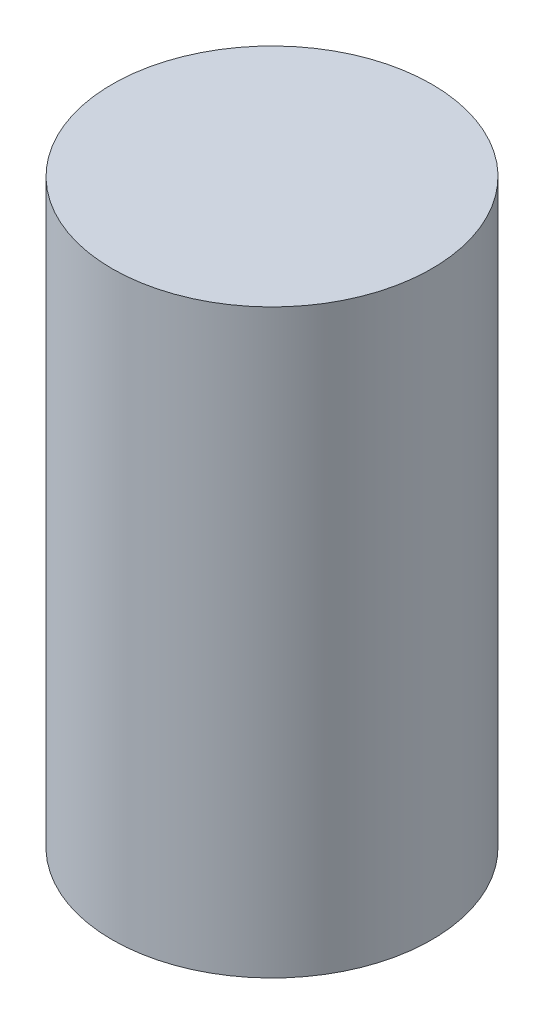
from build123d import *

# Parameters (mm, degrees)
SKETCH1_R           = 22
BOSS_EXTRUDE1_DEPTH = 80


with BuildPart() as part:
    # Sketch1 → Boss-Extrude1 (new body)
    with BuildSketch(Plane(origin=(0, 0, 0), x_dir=(1, 0, 0), z_dir=(0, 1, 0))):
        with Locations(Location((0, 0, 0), (0, 0, 270))):
            Circle(SKETCH1_R)
    extrude(amount=BOSS_EXTRUDE1_DEPTH)


solid = part.part
